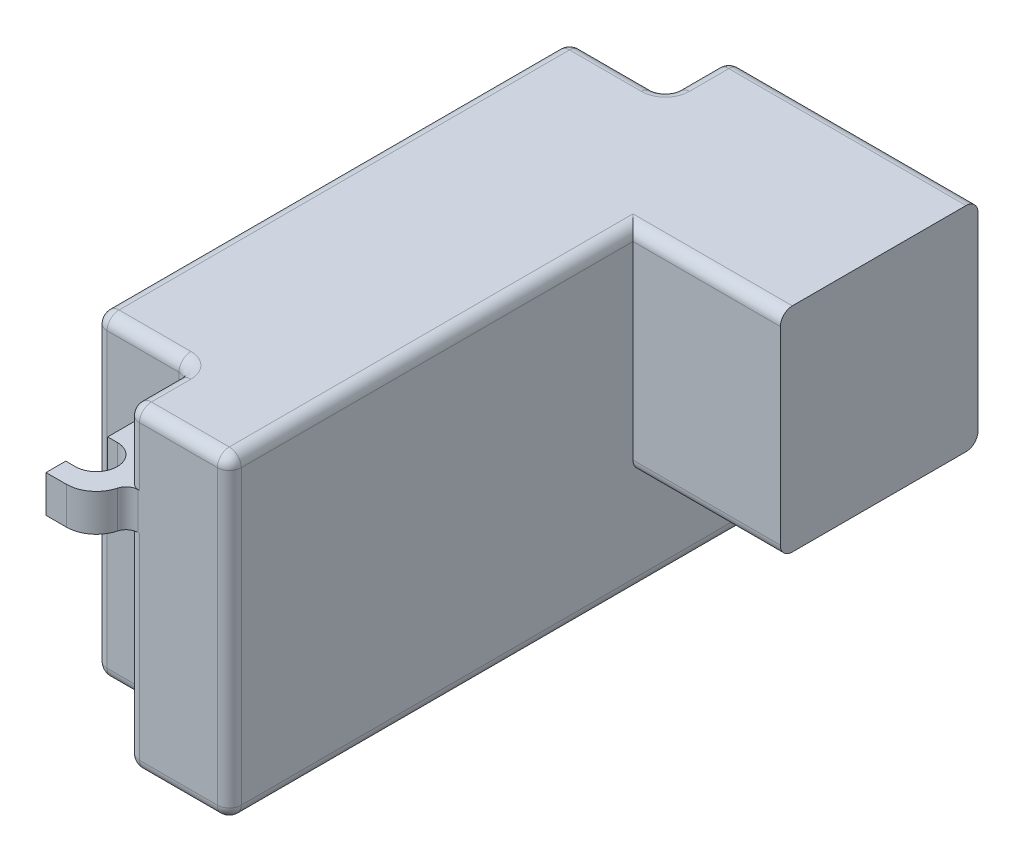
from build123d import *

# Parameters (mm, degrees)
BOSS_EXTRU_1_DEPTH      = 26.4
ESQUISSE2_W             = 12.3
ESQUISSE2_H             = 8.6
ENL_V_MAT_EXTRU_1_DEPTH = 16.5
ESQUISSE3_W             = 7.9
ESQUISSE3_H             = 3.1
BOSS_EXTRU_2_DEPTH      = 4.2
ENL_V_MAT_EXTRU_2_DEPTH = 3.1
CONG_1_R                = 2.5
CONG_1_OF_SYM_TRIE1_R   = 2.5
ESQUISSE5_R             = 2.1
BOSS_EXTRU_3_DEPTH      = 0.5
BOSS_EXTRU_4_DEPTH      = 11
ESQUISSE7_R             = 1.2
BOSS_EXTRU_5_DEPTH      = 4.2
CONG_2_R                = 1
CONG_3_R                = 1


with BuildPart() as part:
    # Esquisse1 → Boss.-Extru.1 (new body)
    with BuildSketch(Plane(origin=(0, 0, 0), x_dir=(1, 0, 0), z_dir=(0, 1, 0))):
        Polygon((0, 44.9), (8, 44.9), (8, 50.2), (28.8, 50.2), (28.8, 33.7), (16.5, 33.7), (16.5, 0), (8, 0), (8, 5.3), (0, 5.3), align=None)
    extrude(amount=BOSS_EXTRU_1_DEPTH)

    # Esquisse2 → Enl_v. mat.-Extru.1 (cut)
    with BuildSketch(Plane(origin=(0, 0, -50.2), x_dir=(-1, 0, 0), z_dir=(0, 0, -1))):
        with Locations((-22.65, 4.3)):
            Rectangle(ESQUISSE2_W, ESQUISSE2_H)
    extrude(amount=-ENL_V_MAT_EXTRU_1_DEPTH, mode=Mode.SUBTRACT)

    # Esquisse3 → Boss.-Extru.2 (add)
    with BuildSketch(Plane.ZY.offset(-8)):
        with Locations((-1.35, 18.95)):
            Rectangle(ESQUISSE3_W, ESQUISSE3_H)
    boss_extru_2 = extrude(amount=BOSS_EXTRU_2_DEPTH)

    # Esquisse4 → Enl_v. mat.-Extru.2 (cut)
    with BuildSketch(Plane(origin=(0, 20.5, 0), x_dir=(1, 0, 0), z_dir=(0, 1, 0))):
        with BuildLine():
            Line((4.6, 2.55), (3.8, 2.55))
            Line((3.8, 2.55), (3.8, -0.95))
            Line((3.8, -0.95), (4.6, -0.95))
            ThreePointArc((4.6, -0.95), (6.35, 0.8), (4.6, 2.55))
        make_face()
    enl_v_mat_extru_2 = extrude(amount=-ENL_V_MAT_EXTRU_2_DEPTH, mode=Mode.SUBTRACT)

    # Cong_1
    cong_1_edges = [part.edges().sort_by_distance(p)[0] for p in [
        (8, 18.95, 2.6),
    ]]
    fillet(cong_1_edges, radius=CONG_1_R)

    # Sym_trie1: Boss.-Extru.2, Enl_v. mat.-Extru.2 across plane
    add(boss_extru_2.mirror(Plane.XY.offset(-25.1)))
    add(enl_v_mat_extru_2.mirror(Plane.XY.offset(-25.1)), mode=Mode.SUBTRACT)

    # Cong_1 of Sym_trie1
    cong_1_of_sym_trie1_edges = [part.edges().sort_by_distance(p)[0] for p in [
        (8, 18.95, -52.8),
    ]]
    fillet(cong_1_of_sym_trie1_edges, radius=CONG_1_OF_SYM_TRIE1_R)

    # Esquisse5 → Boss.-Extru.3 (add)
    with BuildSketch(Plane.ZY):
        with Locations(Location((-25.1, 8.4, 0), (0, 0, 180))):
            Circle(ESQUISSE5_R)
    extrude(amount=BOSS_EXTRU_3_DEPTH)

    # Esquisse6 → Boss.-Extru.4 (add)
    with BuildSketch(Plane.ZY.offset(0.5)):
        Polygon((-25.1, 10.5), (-26.918653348, 9.45), (-26.918653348, 7.35), (-25.1, 6.3), (-23.281346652, 7.35), (-23.281346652, 9.45), align=None)
    extrude(amount=BOSS_EXTRU_4_DEPTH)

    # Esquisse7 → Boss.-Extru.5 (add)
    with BuildSketch(Plane.ZY.offset(11.5)):
        with Locations((-25.1, 8.4)):
            Circle(ESQUISSE7_R)
    extrude(amount=BOSS_EXTRU_5_DEPTH)

    # Cong_2
    cong_2_edges = [part.edges().sort_by_distance(p)[0] for p in [
        (8, 26.4, -2.65),
        (16.5, 0, -25.1),
        (12.25, 0, 0),
        (8, 0, -2.65),
        (4, 0, -5.3),
        (0, 0, -25.1),
        (12.25, 26.4, 0),
        (16.5, 26.4, -16.85),
        (0, 13.2, -44.9),
        (8, 23.45, -44.9),
        (8, 23.45, -50.2),
        (16.5, 13.2, 0),
        (8, 23.45, 0),
        (8, 23.45, -5.3),
        (0, 13.2, -5.3),
        (22.65, 26.4, -33.7),
        (18.4, 26.4, -50.2),
        (8, 26.4, -47.55),
        (12.25, 0, -50.2),
        (4, 26.4, -44.9),
        (22.65, 8.6, -33.7),
        (16.5, 4.3, -50.2),
        (22.65, 8.6, -50.2),
        (0, 26.4, -25.1),
        (8, 8.7, 0),
        (8, 8.7, -5.3),
        (4, 26.4, -5.3),
        (8, 8.7, -44.9),
        (8, 8.7, -50.2),
        (4, 0, -44.9),
        (8, 0, -47.55),
    ]]
    fillet(cong_2_edges, radius=CONG_2_R)

    # Cong_3
    cong_3_edges = [part.edges().sort_by_distance(p)[0] for p in [
        (8, 18.95, 0),
        (8, 18.95, -50.2),
    ]]
    fillet(cong_3_edges, radius=CONG_3_R)


solid = part.part
